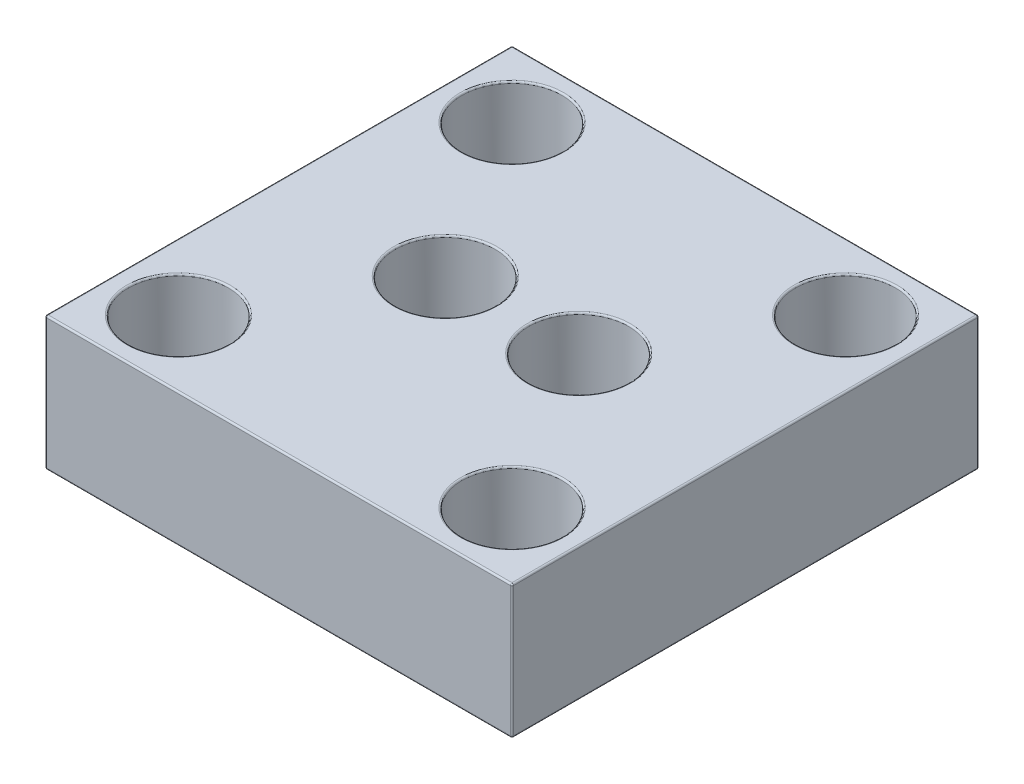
ISO-10303-21;
HEADER;
FILE_DESCRIPTION(('STEP AP214'),'2;1');
FILE_NAME('part.step','',(''),(''),'','','');
FILE_SCHEMA(('AUTOMOTIVE_DESIGN { 1 0 10303 214 1 1 1 1 }'));
ENDSEC;
DATA;
#1=APPLICATION_CONTEXT('core data for automotive mechanical design processes');
#2=APPLICATION_PROTOCOL_DEFINITION('international standard','automotive_design',2000,#1);
#3=PRODUCT_CONTEXT('',#1,'mechanical');
#4=PRODUCT('Part','Part','',(#3));
#5=PRODUCT_RELATED_PRODUCT_CATEGORY('part','',(#4));
#6=PRODUCT_DEFINITION_FORMATION('','',#4);
#7=PRODUCT_DEFINITION_CONTEXT('part definition',#1,'design');
#8=PRODUCT_DEFINITION('design','',#6,#7);
#9=PRODUCT_DEFINITION_SHAPE('','',#8);
#10=(LENGTH_UNIT() NAMED_UNIT(*) SI_UNIT(.MILLI.,.METRE.));
#11=(NAMED_UNIT(*) PLANE_ANGLE_UNIT() SI_UNIT($,.RADIAN.));
#12=(NAMED_UNIT(*) SI_UNIT($,.STERADIAN.) SOLID_ANGLE_UNIT());
#13=UNCERTAINTY_MEASURE_WITH_UNIT(LENGTH_MEASURE(1.E-05),#10,'distance_accuracy_value','');
#14=(GEOMETRIC_REPRESENTATION_CONTEXT(3) GLOBAL_UNCERTAINTY_ASSIGNED_CONTEXT((#13)) GLOBAL_UNIT_ASSIGNED_CONTEXT((#10,
#11,#12)) REPRESENTATION_CONTEXT('',''));
#15=CARTESIAN_POINT('',(0.,0.,0.));
#16=DIRECTION('',(0.,0.,1.));
#17=DIRECTION('',(1.,0.,0.));
#18=AXIS2_PLACEMENT_3D('',#15,#16,#17);
#19=CARTESIAN_POINT('',(60.,0.,-9.99999999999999));
#20=DIRECTION('',(0.,1.,0.));
#21=DIRECTION('',(0.,0.,1.));
#22=AXIS2_PLACEMENT_3D('',#19,#20,#21);
#23=CYLINDRICAL_SURFACE('',#22,4.5);
#24=CARTESIAN_POINT('',(60.,0.25,-9.99999999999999));
#25=DIRECTION('',(0.,-1.,0.));
#26=DIRECTION('',(0.,0.,-1.));
#27=AXIS2_PLACEMENT_3D('',#24,#25,#26);
#28=CIRCLE('',#27,4.5);
#29=CARTESIAN_POINT('',(60.,0.25,-14.5));
#30=VERTEX_POINT('',#29);
#31=EDGE_CURVE('E199',#30,#30,#28,.T.);
#32=ORIENTED_EDGE('',*,*,#31,.T.);
#33=EDGE_LOOP('',(#32));
#34=FACE_BOUND('',#33,.T.);
#35=CARTESIAN_POINT('',(60.,8.,-9.99999999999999));
#36=DIRECTION('',(0.,1.,0.));
#37=DIRECTION('',(0.,0.,1.));
#38=AXIS2_PLACEMENT_3D('',#35,#36,#37);
#39=CIRCLE('',#38,4.5);
#40=CARTESIAN_POINT('',(60.,8.,-5.49999999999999));
#41=VERTEX_POINT('',#40);
#42=EDGE_CURVE('E166',#41,#41,#39,.F.);
#43=ORIENTED_EDGE('',*,*,#42,.F.);
#44=EDGE_LOOP('',(#43));
#45=FACE_BOUND('',#44,.T.);
#46=ADVANCED_FACE('F35',(#34,#45),#23,.F.);
#47=CARTESIAN_POINT('',(60.,0.,-60.));
#48=DIRECTION('',(0.,1.,0.));
#49=DIRECTION('',(0.,0.,1.));
#50=AXIS2_PLACEMENT_3D('',#47,#48,#49);
#51=CYLINDRICAL_SURFACE('',#50,4.5);
#52=CARTESIAN_POINT('',(60.,0.25,-60.));
#53=DIRECTION('',(0.,-1.,0.));
#54=DIRECTION('',(0.,0.,-1.));
#55=AXIS2_PLACEMENT_3D('',#52,#53,#54);
#56=CIRCLE('',#55,4.5);
#57=CARTESIAN_POINT('',(60.,0.25,-64.5));
#58=VERTEX_POINT('',#57);
#59=EDGE_CURVE('E205',#58,#58,#56,.T.);
#60=ORIENTED_EDGE('',*,*,#59,.T.);
#61=EDGE_LOOP('',(#60));
#62=FACE_BOUND('',#61,.T.);
#63=CARTESIAN_POINT('',(60.,8.,-60.));
#64=DIRECTION('',(0.,1.,0.));
#65=DIRECTION('',(0.,0.,1.));
#66=AXIS2_PLACEMENT_3D('',#63,#64,#65);
#67=CIRCLE('',#66,4.5);
#68=CARTESIAN_POINT('',(60.,8.,-55.5));
#69=VERTEX_POINT('',#68);
#70=EDGE_CURVE('E348',#69,#69,#67,.F.);
#71=ORIENTED_EDGE('',*,*,#70,.F.);
#72=EDGE_LOOP('',(#71));
#73=FACE_BOUND('',#72,.T.);
#74=ADVANCED_FACE('F373',(#62,#73),#51,.F.);
#75=CARTESIAN_POINT('',(45.,0.,-35.));
#76=DIRECTION('',(0.,1.,0.));
#77=DIRECTION('',(0.,0.,1.));
#78=AXIS2_PLACEMENT_3D('',#75,#76,#77);
#79=CYLINDRICAL_SURFACE('',#78,4.50000000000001);
#80=CARTESIAN_POINT('',(45.,0.25,-35.));
#81=DIRECTION('',(0.,-1.,0.));
#82=DIRECTION('',(0.,0.,-1.));
#83=AXIS2_PLACEMENT_3D('',#80,#81,#82);
#84=CIRCLE('',#83,4.50000000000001);
#85=CARTESIAN_POINT('',(45.,0.25,-39.5));
#86=VERTEX_POINT('',#85);
#87=EDGE_CURVE('E202',#86,#86,#84,.T.);
#88=ORIENTED_EDGE('',*,*,#87,.T.);
#89=EDGE_LOOP('',(#88));
#90=FACE_BOUND('',#89,.T.);
#91=CARTESIAN_POINT('',(45.,8.,-35.));
#92=DIRECTION('',(0.,1.,0.));
#93=DIRECTION('',(0.,0.,1.));
#94=AXIS2_PLACEMENT_3D('',#91,#92,#93);
#95=CIRCLE('',#94,4.50000000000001);
#96=CARTESIAN_POINT('',(45.,8.,-30.5));
#97=VERTEX_POINT('',#96);
#98=EDGE_CURVE('E352',#97,#97,#95,.F.);
#99=ORIENTED_EDGE('',*,*,#98,.F.);
#100=EDGE_LOOP('',(#99));
#101=FACE_BOUND('',#100,.T.);
#102=ADVANCED_FACE('F375',(#90,#101),#79,.F.);
#103=CARTESIAN_POINT('',(10.,0.,-9.99999999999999));
#104=DIRECTION('',(0.,1.,0.));
#105=DIRECTION('',(0.,0.,1.));
#106=AXIS2_PLACEMENT_3D('',#103,#104,#105);
#107=CYLINDRICAL_SURFACE('',#106,4.5);
#108=CARTESIAN_POINT('',(10.,0.25,-9.99999999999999));
#109=DIRECTION('',(0.,-1.,0.));
#110=DIRECTION('',(0.,0.,-1.));
#111=AXIS2_PLACEMENT_3D('',#108,#109,#110);
#112=CIRCLE('',#111,4.5);
#113=CARTESIAN_POINT('',(10.,0.25,-14.5));
#114=VERTEX_POINT('',#113);
#115=EDGE_CURVE('E196',#114,#114,#112,.T.);
#116=ORIENTED_EDGE('',*,*,#115,.T.);
#117=EDGE_LOOP('',(#116));
#118=FACE_BOUND('',#117,.T.);
#119=CARTESIAN_POINT('',(10.,8.,-9.99999999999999));
#120=DIRECTION('',(0.,1.,0.));
#121=DIRECTION('',(0.,0.,1.));
#122=AXIS2_PLACEMENT_3D('',#119,#120,#121);
#123=CIRCLE('',#122,4.5);
#124=CARTESIAN_POINT('',(10.,8.,-5.49999999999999));
#125=VERTEX_POINT('',#124);
#126=EDGE_CURVE('E356',#125,#125,#123,.F.);
#127=ORIENTED_EDGE('',*,*,#126,.F.);
#128=EDGE_LOOP('',(#127));
#129=FACE_BOUND('',#128,.T.);
#130=ADVANCED_FACE('F382',(#118,#129),#107,.F.);
#131=CARTESIAN_POINT('',(25.,0.,-35.));
#132=DIRECTION('',(0.,1.,0.));
#133=DIRECTION('',(0.,0.,1.));
#134=AXIS2_PLACEMENT_3D('',#131,#132,#133);
#135=CYLINDRICAL_SURFACE('',#134,4.50000000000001);
#136=CARTESIAN_POINT('',(25.,0.25,-35.));
#137=DIRECTION('',(0.,-1.,0.));
#138=DIRECTION('',(0.,0.,-1.));
#139=AXIS2_PLACEMENT_3D('',#136,#137,#138);
#140=CIRCLE('',#139,4.50000000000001);
#141=CARTESIAN_POINT('',(25.,0.25,-39.5));
#142=VERTEX_POINT('',#141);
#143=EDGE_CURVE('E193',#142,#142,#140,.T.);
#144=ORIENTED_EDGE('',*,*,#143,.T.);
#145=EDGE_LOOP('',(#144));
#146=FACE_BOUND('',#145,.T.);
#147=CARTESIAN_POINT('',(25.,8.,-35.));
#148=DIRECTION('',(0.,1.,0.));
#149=DIRECTION('',(0.,0.,1.));
#150=AXIS2_PLACEMENT_3D('',#147,#148,#149);
#151=CIRCLE('',#150,4.50000000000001);
#152=CARTESIAN_POINT('',(25.,8.,-30.5));
#153=VERTEX_POINT('',#152);
#154=EDGE_CURVE('E360',#153,#153,#151,.F.);
#155=ORIENTED_EDGE('',*,*,#154,.F.);
#156=EDGE_LOOP('',(#155));
#157=FACE_BOUND('',#156,.T.);
#158=ADVANCED_FACE('F393',(#146,#157),#135,.F.);
#159=CARTESIAN_POINT('',(10.,0.,-60.));
#160=DIRECTION('',(0.,1.,0.));
#161=DIRECTION('',(0.,0.,1.));
#162=AXIS2_PLACEMENT_3D('',#159,#160,#161);
#163=CYLINDRICAL_SURFACE('',#162,4.5);
#164=CARTESIAN_POINT('',(10.,0.25,-60.));
#165=DIRECTION('',(0.,-1.,0.));
#166=DIRECTION('',(0.,0.,-1.));
#167=AXIS2_PLACEMENT_3D('',#164,#165,#166);
#168=CIRCLE('',#167,4.5);
#169=CARTESIAN_POINT('',(10.,0.25,-64.5));
#170=VERTEX_POINT('',#169);
#171=EDGE_CURVE('E190',#170,#170,#168,.T.);
#172=ORIENTED_EDGE('',*,*,#171,.T.);
#173=EDGE_LOOP('',(#172));
#174=FACE_BOUND('',#173,.T.);
#175=CARTESIAN_POINT('',(10.,8.,-60.));
#176=DIRECTION('',(0.,1.,0.));
#177=DIRECTION('',(0.,0.,1.));
#178=AXIS2_PLACEMENT_3D('',#175,#176,#177);
#179=CIRCLE('',#178,4.5);
#180=CARTESIAN_POINT('',(10.,8.,-55.5));
#181=VERTEX_POINT('',#180);
#182=EDGE_CURVE('E160',#181,#181,#179,.F.);
#183=ORIENTED_EDGE('',*,*,#182,.F.);
#184=EDGE_LOOP('',(#183));
#185=FACE_BOUND('',#184,.T.);
#186=ADVANCED_FACE('F397',(#174,#185),#163,.F.);
#187=CARTESIAN_POINT('',(0.,20.,0.));
#188=DIRECTION('',(1.,0.,0.));
#189=DIRECTION('',(0.,0.,-1.));
#190=AXIS2_PLACEMENT_3D('',#187,#188,#189);
#191=PLANE('',#190);
#192=DIRECTION('',(0.,-1.,0.));
#193=VECTOR('',#192,1.);
#194=CARTESIAN_POINT('',(0.,20.,-69.75));
#195=LINE('',#194,#193);
#196=CARTESIAN_POINT('',(0.,19.75,-69.75));
#197=VERTEX_POINT('',#196);
#198=CARTESIAN_POINT('',(0.,0.25,-69.75));
#199=VERTEX_POINT('',#198);
#200=EDGE_CURVE('E212',#197,#199,#195,.T.);
#201=ORIENTED_EDGE('',*,*,#200,.T.);
#202=DIRECTION('',(0.,0.,1.));
#203=VECTOR('',#202,1.);
#204=CARTESIAN_POINT('',(0.,0.25,0.));
#205=LINE('',#204,#203);
#206=CARTESIAN_POINT('',(0.,0.25,-0.25));
#207=VERTEX_POINT('',#206);
#208=EDGE_CURVE('E214',#199,#207,#205,.T.);
#209=ORIENTED_EDGE('',*,*,#208,.T.);
#210=DIRECTION('',(0.,-1.,0.));
#211=VECTOR('',#210,1.);
#212=CARTESIAN_POINT('',(0.,20.,-0.25));
#213=LINE('',#212,#211);
#214=CARTESIAN_POINT('',(0.,19.75,-0.25));
#215=VERTEX_POINT('',#214);
#216=EDGE_CURVE('E210',#207,#215,#213,.F.);
#217=ORIENTED_EDGE('',*,*,#216,.T.);
#218=DIRECTION('',(0.,0.,1.));
#219=VECTOR('',#218,1.);
#220=CARTESIAN_POINT('',(0.,19.75,0.));
#221=LINE('',#220,#219);
#222=EDGE_CURVE('E208',#215,#197,#221,.F.);
#223=ORIENTED_EDGE('',*,*,#222,.T.);
#224=EDGE_LOOP('',(#201,#209,#217,#223));
#225=FACE_BOUND('',#224,.T.);
#226=ADVANCED_FACE('F401',(#225),#191,.F.);
#227=CARTESIAN_POINT('',(0.,20.,0.));
#228=DIRECTION('',(0.,0.,-1.));
#229=DIRECTION('',(-1.,0.,0.));
#230=AXIS2_PLACEMENT_3D('',#227,#228,#229);
#231=PLANE('',#230);
#232=DIRECTION('',(0.,-1.,0.));
#233=VECTOR('',#232,1.);
#234=CARTESIAN_POINT('',(0.25,20.,0.));
#235=LINE('',#234,#233);
#236=CARTESIAN_POINT('',(0.25,19.75,0.));
#237=VERTEX_POINT('',#236);
#238=CARTESIAN_POINT('',(0.25,0.25,0.));
#239=VERTEX_POINT('',#238);
#240=EDGE_CURVE('E238',#237,#239,#235,.T.);
#241=ORIENTED_EDGE('',*,*,#240,.T.);
#242=DIRECTION('',(1.,0.,0.));
#243=VECTOR('',#242,1.);
#244=CARTESIAN_POINT('',(70.,0.25,0.));
#245=LINE('',#244,#243);
#246=CARTESIAN_POINT('',(69.75,0.25,0.));
#247=VERTEX_POINT('',#246);
#248=EDGE_CURVE('E241',#239,#247,#245,.T.);
#249=ORIENTED_EDGE('',*,*,#248,.T.);
#250=DIRECTION('',(0.,-1.,0.));
#251=VECTOR('',#250,1.);
#252=CARTESIAN_POINT('',(69.75,20.,0.));
#253=LINE('',#252,#251);
#254=CARTESIAN_POINT('',(69.75,19.75,0.));
#255=VERTEX_POINT('',#254);
#256=EDGE_CURVE('E236',#247,#255,#253,.F.);
#257=ORIENTED_EDGE('',*,*,#256,.T.);
#258=DIRECTION('',(1.,0.,0.));
#259=VECTOR('',#258,1.);
#260=CARTESIAN_POINT('',(0.,19.75,0.));
#261=LINE('',#260,#259);
#262=EDGE_CURVE('E234',#255,#237,#261,.F.);
#263=ORIENTED_EDGE('',*,*,#262,.T.);
#264=EDGE_LOOP('',(#241,#249,#257,#263));
#265=FACE_BOUND('',#264,.T.);
#266=ADVANCED_FACE('F417',(#265),#231,.F.);
#267=CARTESIAN_POINT('',(70.,20.,0.));
#268=DIRECTION('',(-1.,0.,0.));
#269=DIRECTION('',(0.,0.,1.));
#270=AXIS2_PLACEMENT_3D('',#267,#268,#269);
#271=PLANE('',#270);
#272=DIRECTION('',(0.,0.,-1.));
#273=VECTOR('',#272,1.);
#274=CARTESIAN_POINT('',(70.,0.25,-70.));
#275=LINE('',#274,#273);
#276=CARTESIAN_POINT('',(70.,0.25,-0.25));
#277=VERTEX_POINT('',#276);
#278=CARTESIAN_POINT('',(70.,0.25,-69.75));
#279=VERTEX_POINT('',#278);
#280=EDGE_CURVE('E142',#277,#279,#275,.T.);
#281=ORIENTED_EDGE('',*,*,#280,.T.);
#282=DIRECTION('',(0.,-1.,0.));
#283=VECTOR('',#282,1.);
#284=CARTESIAN_POINT('',(70.,20.,-69.75));
#285=LINE('',#284,#283);
#286=CARTESIAN_POINT('',(70.,19.75,-69.75));
#287=VERTEX_POINT('',#286);
#288=EDGE_CURVE('E231',#279,#287,#285,.F.);
#289=ORIENTED_EDGE('',*,*,#288,.T.);
#290=DIRECTION('',(0.,0.,-1.));
#291=VECTOR('',#290,1.);
#292=CARTESIAN_POINT('',(70.,19.75,0.));
#293=LINE('',#292,#291);
#294=CARTESIAN_POINT('',(70.,19.75,-0.25));
#295=VERTEX_POINT('',#294);
#296=EDGE_CURVE('E226',#287,#295,#293,.F.);
#297=ORIENTED_EDGE('',*,*,#296,.T.);
#298=DIRECTION('',(0.,-1.,0.));
#299=VECTOR('',#298,1.);
#300=CARTESIAN_POINT('',(70.,20.,-0.25));
#301=LINE('',#300,#299);
#302=EDGE_CURVE('E228',#295,#277,#301,.T.);
#303=ORIENTED_EDGE('',*,*,#302,.T.);
#304=EDGE_LOOP('',(#281,#289,#297,#303));
#305=FACE_BOUND('',#304,.T.);
#306=ADVANCED_FACE('F413',(#305),#271,.F.);
#307=CARTESIAN_POINT('',(0.,20.,-70.));
#308=DIRECTION('',(0.,0.,1.));
#309=DIRECTION('',(1.,0.,0.));
#310=AXIS2_PLACEMENT_3D('',#307,#308,#309);
#311=PLANE('',#310);
#312=DIRECTION('',(-1.,0.,0.));
#313=VECTOR('',#312,1.);
#314=CARTESIAN_POINT('',(0.,0.25,-70.));
#315=LINE('',#314,#313);
#316=CARTESIAN_POINT('',(69.75,0.25,-70.));
#317=VERTEX_POINT('',#316);
#318=CARTESIAN_POINT('',(0.25,0.25,-70.));
#319=VERTEX_POINT('',#318);
#320=EDGE_CURVE('E221',#317,#319,#315,.T.);
#321=ORIENTED_EDGE('',*,*,#320,.T.);
#322=DIRECTION('',(0.,-1.,0.));
#323=VECTOR('',#322,1.);
#324=CARTESIAN_POINT('',(0.25,20.,-70.));
#325=LINE('',#324,#323);
#326=CARTESIAN_POINT('',(0.25,19.75,-70.));
#327=VERTEX_POINT('',#326);
#328=EDGE_CURVE('E223',#319,#327,#325,.F.);
#329=ORIENTED_EDGE('',*,*,#328,.T.);
#330=DIRECTION('',(-1.,0.,0.));
#331=VECTOR('',#330,1.);
#332=CARTESIAN_POINT('',(0.,19.75,-70.));
#333=LINE('',#332,#331);
#334=CARTESIAN_POINT('',(69.75,19.75,-70.));
#335=VERTEX_POINT('',#334);
#336=EDGE_CURVE('E217',#327,#335,#333,.F.);
#337=ORIENTED_EDGE('',*,*,#336,.T.);
#338=DIRECTION('',(0.,-1.,0.));
#339=VECTOR('',#338,1.);
#340=CARTESIAN_POINT('',(69.75,20.,-70.));
#341=LINE('',#340,#339);
#342=EDGE_CURVE('E219',#335,#317,#341,.T.);
#343=ORIENTED_EDGE('',*,*,#342,.T.);
#344=EDGE_LOOP('',(#321,#329,#337,#343));
#345=FACE_BOUND('',#344,.T.);
#346=ADVANCED_FACE('F406',(#345),#311,.F.);
#347=CARTESIAN_POINT('',(0.,20.,-70.));
#348=DIRECTION('',(0.,-1.,0.));
#349=DIRECTION('',(0.,0.,-1.));
#350=AXIS2_PLACEMENT_3D('',#347,#348,#349);
#351=PLANE('',#350);
#352=DIRECTION('',(0.,0.,-1.));
#353=VECTOR('',#352,1.);
#354=CARTESIAN_POINT('',(69.75,20.,-70.));
#355=LINE('',#354,#353);
#356=CARTESIAN_POINT('',(69.75,20.,-0.25));
#357=VERTEX_POINT('',#356);
#358=CARTESIAN_POINT('',(69.75,20.,-69.75));
#359=VERTEX_POINT('',#358);
#360=EDGE_CURVE('E52',#357,#359,#355,.T.);
#361=ORIENTED_EDGE('',*,*,#360,.T.);
#362=DIRECTION('',(-1.,0.,0.));
#363=VECTOR('',#362,1.);
#364=CARTESIAN_POINT('',(0.,20.,-69.75));
#365=LINE('',#364,#363);
#366=CARTESIAN_POINT('',(0.25,20.,-69.75));
#367=VERTEX_POINT('',#366);
#368=EDGE_CURVE('E265',#359,#367,#365,.T.);
#369=ORIENTED_EDGE('',*,*,#368,.T.);
#370=DIRECTION('',(0.,0.,1.));
#371=VECTOR('',#370,1.);
#372=CARTESIAN_POINT('',(0.25,20.,-70.));
#373=LINE('',#372,#371);
#374=CARTESIAN_POINT('',(0.25,20.,-0.25));
#375=VERTEX_POINT('',#374);
#376=EDGE_CURVE('E261',#367,#375,#373,.T.);
#377=ORIENTED_EDGE('',*,*,#376,.T.);
#378=DIRECTION('',(1.,0.,0.));
#379=VECTOR('',#378,1.);
#380=CARTESIAN_POINT('',(0.,20.,-0.25));
#381=LINE('',#380,#379);
#382=EDGE_CURVE('E57',#375,#357,#381,.T.);
#383=ORIENTED_EDGE('',*,*,#382,.T.);
#384=EDGE_LOOP('',(#361,#369,#377,#383));
#385=FACE_BOUND('',#384,.T.);
#386=CARTESIAN_POINT('',(10.,20.,-60.));
#387=DIRECTION('',(0.,-1.,0.));
#388=DIRECTION('',(0.,0.,-1.));
#389=AXIS2_PLACEMENT_3D('',#386,#387,#388);
#390=CIRCLE('',#389,7.75);
#391=CARTESIAN_POINT('',(10.,20.,-67.75));
#392=VERTEX_POINT('',#391);
#393=EDGE_CURVE('E258',#392,#392,#390,.T.);
#394=ORIENTED_EDGE('',*,*,#393,.T.);
#395=EDGE_LOOP('',(#394));
#396=FACE_BOUND('',#395,.T.);
#397=CARTESIAN_POINT('',(25.,20.,-35.));
#398=DIRECTION('',(0.,-1.,0.));
#399=DIRECTION('',(0.,0.,-1.));
#400=AXIS2_PLACEMENT_3D('',#397,#398,#399);
#401=CIRCLE('',#400,7.75);
#402=CARTESIAN_POINT('',(25.,20.,-42.75));
#403=VERTEX_POINT('',#402);
#404=EDGE_CURVE('E255',#403,#403,#401,.T.);
#405=ORIENTED_EDGE('',*,*,#404,.T.);
#406=EDGE_LOOP('',(#405));
#407=FACE_BOUND('',#406,.T.);
#408=CARTESIAN_POINT('',(10.,20.,-9.99999999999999));
#409=DIRECTION('',(0.,-1.,0.));
#410=DIRECTION('',(0.,0.,-1.));
#411=AXIS2_PLACEMENT_3D('',#408,#409,#410);
#412=CIRCLE('',#411,7.75);
#413=CARTESIAN_POINT('',(10.,20.,-17.75));
#414=VERTEX_POINT('',#413);
#415=EDGE_CURVE('E252',#414,#414,#412,.T.);
#416=ORIENTED_EDGE('',*,*,#415,.T.);
#417=EDGE_LOOP('',(#416));
#418=FACE_BOUND('',#417,.T.);
#419=CARTESIAN_POINT('',(45.,20.,-35.));
#420=DIRECTION('',(0.,-1.,0.));
#421=DIRECTION('',(0.,0.,-1.));
#422=AXIS2_PLACEMENT_3D('',#419,#420,#421);
#423=CIRCLE('',#422,7.75);
#424=CARTESIAN_POINT('',(45.,20.,-42.75));
#425=VERTEX_POINT('',#424);
#426=EDGE_CURVE('E249',#425,#425,#423,.T.);
#427=ORIENTED_EDGE('',*,*,#426,.T.);
#428=EDGE_LOOP('',(#427));
#429=FACE_BOUND('',#428,.T.);
#430=CARTESIAN_POINT('',(60.,20.,-60.));
#431=DIRECTION('',(0.,-1.,0.));
#432=DIRECTION('',(0.,0.,-1.));
#433=AXIS2_PLACEMENT_3D('',#430,#431,#432);
#434=CIRCLE('',#433,7.75000000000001);
#435=CARTESIAN_POINT('',(60.,20.,-67.75));
#436=VERTEX_POINT('',#435);
#437=EDGE_CURVE('E246',#436,#436,#434,.T.);
#438=ORIENTED_EDGE('',*,*,#437,.T.);
#439=EDGE_LOOP('',(#438));
#440=FACE_BOUND('',#439,.T.);
#441=CARTESIAN_POINT('',(60.,20.,-9.99999999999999));
#442=DIRECTION('',(0.,-1.,0.));
#443=DIRECTION('',(0.,0.,-1.));
#444=AXIS2_PLACEMENT_3D('',#441,#442,#443);
#445=CIRCLE('',#444,7.75000000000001);
#446=CARTESIAN_POINT('',(60.,20.,-17.75));
#447=VERTEX_POINT('',#446);
#448=EDGE_CURVE('E243',#447,#447,#445,.T.);
#449=ORIENTED_EDGE('',*,*,#448,.T.);
#450=EDGE_LOOP('',(#449));
#451=FACE_BOUND('',#450,.T.);
#452=ADVANCED_FACE('F403',(#385,#396,#407,#418,#429,#440,#451),#351,.F.);
#453=CARTESIAN_POINT('',(0.,0.,-70.));
#454=DIRECTION('',(0.,-1.,0.));
#455=DIRECTION('',(0.,0.,-1.));
#456=AXIS2_PLACEMENT_3D('',#453,#454,#455);
#457=PLANE('',#456);
#458=CARTESIAN_POINT('',(10.,0.,-60.));
#459=DIRECTION('',(0.,-1.,0.));
#460=DIRECTION('',(0.,0.,-1.));
#461=AXIS2_PLACEMENT_3D('',#458,#459,#460);
#462=CIRCLE('',#461,4.75);
#463=CARTESIAN_POINT('',(10.,0.,-64.75));
#464=VERTEX_POINT('',#463);
#465=EDGE_CURVE('E187',#464,#464,#462,.F.);
#466=ORIENTED_EDGE('',*,*,#465,.T.);
#467=EDGE_LOOP('',(#466));
#468=FACE_BOUND('',#467,.T.);
#469=CARTESIAN_POINT('',(25.,0.,-35.));
#470=DIRECTION('',(0.,-1.,0.));
#471=DIRECTION('',(0.,0.,-1.));
#472=AXIS2_PLACEMENT_3D('',#469,#470,#471);
#473=CIRCLE('',#472,4.75000000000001);
#474=CARTESIAN_POINT('',(25.,0.,-39.75));
#475=VERTEX_POINT('',#474);
#476=EDGE_CURVE('E184',#475,#475,#473,.F.);
#477=ORIENTED_EDGE('',*,*,#476,.T.);
#478=EDGE_LOOP('',(#477));
#479=FACE_BOUND('',#478,.T.);
#480=CARTESIAN_POINT('',(10.,0.,-9.99999999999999));
#481=DIRECTION('',(0.,-1.,0.));
#482=DIRECTION('',(0.,0.,-1.));
#483=AXIS2_PLACEMENT_3D('',#480,#481,#482);
#484=CIRCLE('',#483,4.75);
#485=CARTESIAN_POINT('',(10.,0.,-14.75));
#486=VERTEX_POINT('',#485);
#487=EDGE_CURVE('E181',#486,#486,#484,.F.);
#488=ORIENTED_EDGE('',*,*,#487,.T.);
#489=EDGE_LOOP('',(#488));
#490=FACE_BOUND('',#489,.T.);
#491=CARTESIAN_POINT('',(60.,0.,-9.99999999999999));
#492=DIRECTION('',(0.,-1.,0.));
#493=DIRECTION('',(0.,0.,-1.));
#494=AXIS2_PLACEMENT_3D('',#491,#492,#493);
#495=CIRCLE('',#494,4.75000000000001);
#496=CARTESIAN_POINT('',(60.,0.,-14.75));
#497=VERTEX_POINT('',#496);
#498=EDGE_CURVE('E178',#497,#497,#495,.F.);
#499=ORIENTED_EDGE('',*,*,#498,.T.);
#500=EDGE_LOOP('',(#499));
#501=FACE_BOUND('',#500,.T.);
#502=CARTESIAN_POINT('',(45.,0.,-35.));
#503=DIRECTION('',(0.,-1.,0.));
#504=DIRECTION('',(0.,0.,-1.));
#505=AXIS2_PLACEMENT_3D('',#502,#503,#504);
#506=CIRCLE('',#505,4.75000000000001);
#507=CARTESIAN_POINT('',(45.,0.,-39.75));
#508=VERTEX_POINT('',#507);
#509=EDGE_CURVE('E175',#508,#508,#506,.F.);
#510=ORIENTED_EDGE('',*,*,#509,.T.);
#511=EDGE_LOOP('',(#510));
#512=FACE_BOUND('',#511,.T.);
#513=CARTESIAN_POINT('',(60.,0.,-60.));
#514=DIRECTION('',(0.,-1.,0.));
#515=DIRECTION('',(0.,0.,-1.));
#516=AXIS2_PLACEMENT_3D('',#513,#514,#515);
#517=CIRCLE('',#516,4.75);
#518=CARTESIAN_POINT('',(60.,0.,-64.75));
#519=VERTEX_POINT('',#518);
#520=EDGE_CURVE('E172',#519,#519,#517,.F.);
#521=ORIENTED_EDGE('',*,*,#520,.T.);
#522=EDGE_LOOP('',(#521));
#523=FACE_BOUND('',#522,.T.);
#524=DIRECTION('',(1.,0.,0.));
#525=VECTOR('',#524,1.);
#526=CARTESIAN_POINT('',(0.,0.,-0.25));
#527=LINE('',#526,#525);
#528=CARTESIAN_POINT('',(69.75,0.,-0.25));
#529=VERTEX_POINT('',#528);
#530=CARTESIAN_POINT('',(0.25,0.,-0.25));
#531=VERTEX_POINT('',#530);
#532=EDGE_CURVE('E129',#529,#531,#527,.F.);
#533=ORIENTED_EDGE('',*,*,#532,.T.);
#534=DIRECTION('',(0.,0.,1.));
#535=VECTOR('',#534,1.);
#536=CARTESIAN_POINT('',(0.25,0.,-70.));
#537=LINE('',#536,#535);
#538=CARTESIAN_POINT('',(0.25,0.,-69.75));
#539=VERTEX_POINT('',#538);
#540=EDGE_CURVE('E170',#531,#539,#537,.F.);
#541=ORIENTED_EDGE('',*,*,#540,.T.);
#542=DIRECTION('',(-1.,0.,0.));
#543=VECTOR('',#542,1.);
#544=CARTESIAN_POINT('',(70.,0.,-69.75));
#545=LINE('',#544,#543);
#546=CARTESIAN_POINT('',(69.75,0.,-69.75));
#547=VERTEX_POINT('',#546);
#548=EDGE_CURVE('E132',#539,#547,#545,.F.);
#549=ORIENTED_EDGE('',*,*,#548,.T.);
#550=DIRECTION('',(0.,0.,-1.));
#551=VECTOR('',#550,1.);
#552=CARTESIAN_POINT('',(69.75,0.,0.));
#553=LINE('',#552,#551);
#554=EDGE_CURVE('E124',#547,#529,#553,.F.);
#555=ORIENTED_EDGE('',*,*,#554,.T.);
#556=EDGE_LOOP('',(#533,#541,#549,#555));
#557=FACE_BOUND('',#556,.T.);
#558=ADVANCED_FACE('F126',(#468,#479,#490,#501,#512,#523,#557),#457,.T.);
#559=CARTESIAN_POINT('',(10.,8.,-60.));
#560=DIRECTION('',(0.,1.,0.));
#561=DIRECTION('',(0.,0.,1.));
#562=AXIS2_PLACEMENT_3D('',#559,#560,#561);
#563=PLANE('',#562);
#564=CARTESIAN_POINT('',(10.,8.,-60.));
#565=DIRECTION('',(0.,1.,0.));
#566=DIRECTION('',(0.,0.,1.));
#567=AXIS2_PLACEMENT_3D('',#564,#565,#566);
#568=CIRCLE('',#567,7.5);
#569=CARTESIAN_POINT('',(10.,8.,-52.5));
#570=VERTEX_POINT('',#569);
#571=EDGE_CURVE('E163',#570,#570,#568,.T.);
#572=ORIENTED_EDGE('',*,*,#571,.T.);
#573=EDGE_LOOP('',(#572));
#574=FACE_BOUND('',#573,.T.);
#575=ORIENTED_EDGE('',*,*,#182,.T.);
#576=EDGE_LOOP('',(#575));
#577=FACE_BOUND('',#576,.T.);
#578=ADVANCED_FACE('F409',(#574,#577),#563,.T.);
#579=CARTESIAN_POINT('',(10.,8.,-60.));
#580=DIRECTION('',(0.,1.,0.));
#581=DIRECTION('',(0.,0.,1.));
#582=AXIS2_PLACEMENT_3D('',#579,#580,#581);
#583=CYLINDRICAL_SURFACE('',#582,7.5);
#584=CARTESIAN_POINT('',(10.,19.75,-60.));
#585=DIRECTION('',(0.,-1.,0.));
#586=DIRECTION('',(0.,0.,-1.));
#587=AXIS2_PLACEMENT_3D('',#584,#585,#586);
#588=CIRCLE('',#587,7.5);
#589=CARTESIAN_POINT('',(10.,19.75,-67.5));
#590=VERTEX_POINT('',#589);
#591=EDGE_CURVE('E267',#590,#590,#588,.F.);
#592=ORIENTED_EDGE('',*,*,#591,.T.);
#593=EDGE_LOOP('',(#592));
#594=FACE_BOUND('',#593,.T.);
#595=ORIENTED_EDGE('',*,*,#571,.F.);
#596=EDGE_LOOP('',(#595));
#597=FACE_BOUND('',#596,.T.);
#598=ADVANCED_FACE('F388',(#594,#597),#583,.F.);
#599=CARTESIAN_POINT('',(25.,8.,-35.));
#600=DIRECTION('',(0.,1.,0.));
#601=DIRECTION('',(0.,0.,1.));
#602=AXIS2_PLACEMENT_3D('',#599,#600,#601);
#603=PLANE('',#602);
#604=CARTESIAN_POINT('',(25.,8.,-35.));
#605=DIRECTION('',(0.,1.,0.));
#606=DIRECTION('',(0.,0.,1.));
#607=AXIS2_PLACEMENT_3D('',#604,#605,#606);
#608=CIRCLE('',#607,7.5);
#609=CARTESIAN_POINT('',(25.,8.,-27.5));
#610=VERTEX_POINT('',#609);
#611=EDGE_CURVE('E357',#610,#610,#608,.T.);
#612=ORIENTED_EDGE('',*,*,#611,.T.);
#613=EDGE_LOOP('',(#612));
#614=FACE_BOUND('',#613,.T.);
#615=ORIENTED_EDGE('',*,*,#154,.T.);
#616=EDGE_LOOP('',(#615));
#617=FACE_BOUND('',#616,.T.);
#618=ADVANCED_FACE('F579',(#614,#617),#603,.T.);
#619=CARTESIAN_POINT('',(25.,8.,-35.));
#620=DIRECTION('',(0.,1.,0.));
#621=DIRECTION('',(0.,0.,1.));
#622=AXIS2_PLACEMENT_3D('',#619,#620,#621);
#623=CYLINDRICAL_SURFACE('',#622,7.5);
#624=CARTESIAN_POINT('',(25.,19.75,-35.));
#625=DIRECTION('',(0.,-1.,0.));
#626=DIRECTION('',(0.,0.,-1.));
#627=AXIS2_PLACEMENT_3D('',#624,#625,#626);
#628=CIRCLE('',#627,7.5);
#629=CARTESIAN_POINT('',(25.,19.75,-42.5));
#630=VERTEX_POINT('',#629);
#631=EDGE_CURVE('E270',#630,#630,#628,.F.);
#632=ORIENTED_EDGE('',*,*,#631,.T.);
#633=EDGE_LOOP('',(#632));
#634=FACE_BOUND('',#633,.T.);
#635=ORIENTED_EDGE('',*,*,#611,.F.);
#636=EDGE_LOOP('',(#635));
#637=FACE_BOUND('',#636,.T.);
#638=ADVANCED_FACE('F574',(#634,#637),#623,.F.);
#639=CARTESIAN_POINT('',(10.,8.,-9.99999999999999));
#640=DIRECTION('',(0.,1.,0.));
#641=DIRECTION('',(0.,0.,1.));
#642=AXIS2_PLACEMENT_3D('',#639,#640,#641);
#643=PLANE('',#642);
#644=CARTESIAN_POINT('',(10.,8.,-9.99999999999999));
#645=DIRECTION('',(0.,1.,0.));
#646=DIRECTION('',(0.,0.,1.));
#647=AXIS2_PLACEMENT_3D('',#644,#645,#646);
#648=CIRCLE('',#647,7.5);
#649=CARTESIAN_POINT('',(10.,8.,-2.5));
#650=VERTEX_POINT('',#649);
#651=EDGE_CURVE('E353',#650,#650,#648,.T.);
#652=ORIENTED_EDGE('',*,*,#651,.T.);
#653=EDGE_LOOP('',(#652));
#654=FACE_BOUND('',#653,.T.);
#655=ORIENTED_EDGE('',*,*,#126,.T.);
#656=EDGE_LOOP('',(#655));
#657=FACE_BOUND('',#656,.T.);
#658=ADVANCED_FACE('F571',(#654,#657),#643,.T.);
#659=CARTESIAN_POINT('',(10.,8.,-9.99999999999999));
#660=DIRECTION('',(0.,1.,0.));
#661=DIRECTION('',(0.,0.,1.));
#662=AXIS2_PLACEMENT_3D('',#659,#660,#661);
#663=CYLINDRICAL_SURFACE('',#662,7.5);
#664=CARTESIAN_POINT('',(10.,19.75,-9.99999999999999));
#665=DIRECTION('',(0.,-1.,0.));
#666=DIRECTION('',(0.,0.,-1.));
#667=AXIS2_PLACEMENT_3D('',#664,#665,#666);
#668=CIRCLE('',#667,7.5);
#669=CARTESIAN_POINT('',(10.,19.75,-17.5));
#670=VERTEX_POINT('',#669);
#671=EDGE_CURVE('E273',#670,#670,#668,.F.);
#672=ORIENTED_EDGE('',*,*,#671,.T.);
#673=EDGE_LOOP('',(#672));
#674=FACE_BOUND('',#673,.T.);
#675=ORIENTED_EDGE('',*,*,#651,.F.);
#676=EDGE_LOOP('',(#675));
#677=FACE_BOUND('',#676,.T.);
#678=ADVANCED_FACE('F568',(#674,#677),#663,.F.);
#679=CARTESIAN_POINT('',(45.,8.,-35.));
#680=DIRECTION('',(0.,1.,0.));
#681=DIRECTION('',(0.,0.,1.));
#682=AXIS2_PLACEMENT_3D('',#679,#680,#681);
#683=PLANE('',#682);
#684=CARTESIAN_POINT('',(45.,8.,-35.));
#685=DIRECTION('',(0.,1.,0.));
#686=DIRECTION('',(0.,0.,1.));
#687=AXIS2_PLACEMENT_3D('',#684,#685,#686);
#688=CIRCLE('',#687,7.5);
#689=CARTESIAN_POINT('',(45.,8.,-27.5));
#690=VERTEX_POINT('',#689);
#691=EDGE_CURVE('E349',#690,#690,#688,.T.);
#692=ORIENTED_EDGE('',*,*,#691,.T.);
#693=EDGE_LOOP('',(#692));
#694=FACE_BOUND('',#693,.T.);
#695=ORIENTED_EDGE('',*,*,#98,.T.);
#696=EDGE_LOOP('',(#695));
#697=FACE_BOUND('',#696,.T.);
#698=ADVANCED_FACE('F561',(#694,#697),#683,.T.);
#699=CARTESIAN_POINT('',(45.,8.,-35.));
#700=DIRECTION('',(0.,1.,0.));
#701=DIRECTION('',(0.,0.,1.));
#702=AXIS2_PLACEMENT_3D('',#699,#700,#701);
#703=CYLINDRICAL_SURFACE('',#702,7.5);
#704=CARTESIAN_POINT('',(45.,19.75,-35.));
#705=DIRECTION('',(0.,-1.,0.));
#706=DIRECTION('',(0.,0.,-1.));
#707=AXIS2_PLACEMENT_3D('',#704,#705,#706);
#708=CIRCLE('',#707,7.5);
#709=CARTESIAN_POINT('',(45.,19.75,-42.5));
#710=VERTEX_POINT('',#709);
#711=EDGE_CURVE('E276',#710,#710,#708,.F.);
#712=ORIENTED_EDGE('',*,*,#711,.T.);
#713=EDGE_LOOP('',(#712));
#714=FACE_BOUND('',#713,.T.);
#715=ORIENTED_EDGE('',*,*,#691,.F.);
#716=EDGE_LOOP('',(#715));
#717=FACE_BOUND('',#716,.T.);
#718=ADVANCED_FACE('F556',(#714,#717),#703,.F.);
#719=CARTESIAN_POINT('',(60.,8.,-60.));
#720=DIRECTION('',(0.,1.,0.));
#721=DIRECTION('',(0.,0.,1.));
#722=AXIS2_PLACEMENT_3D('',#719,#720,#721);
#723=PLANE('',#722);
#724=CARTESIAN_POINT('',(60.,8.,-60.));
#725=DIRECTION('',(0.,1.,0.));
#726=DIRECTION('',(0.,0.,1.));
#727=AXIS2_PLACEMENT_3D('',#724,#725,#726);
#728=CIRCLE('',#727,7.50000000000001);
#729=CARTESIAN_POINT('',(60.,8.,-52.5));
#730=VERTEX_POINT('',#729);
#731=EDGE_CURVE('E344',#730,#730,#728,.T.);
#732=ORIENTED_EDGE('',*,*,#731,.T.);
#733=EDGE_LOOP('',(#732));
#734=FACE_BOUND('',#733,.T.);
#735=ORIENTED_EDGE('',*,*,#70,.T.);
#736=EDGE_LOOP('',(#735));
#737=FACE_BOUND('',#736,.T.);
#738=ADVANCED_FACE('F371',(#734,#737),#723,.T.);
#739=CARTESIAN_POINT('',(60.,8.,-60.));
#740=DIRECTION('',(0.,1.,0.));
#741=DIRECTION('',(0.,0.,1.));
#742=AXIS2_PLACEMENT_3D('',#739,#740,#741);
#743=CYLINDRICAL_SURFACE('',#742,7.50000000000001);
#744=CARTESIAN_POINT('',(60.,19.75,-60.));
#745=DIRECTION('',(0.,-1.,0.));
#746=DIRECTION('',(0.,0.,-1.));
#747=AXIS2_PLACEMENT_3D('',#744,#745,#746);
#748=CIRCLE('',#747,7.50000000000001);
#749=CARTESIAN_POINT('',(60.,19.75,-67.5));
#750=VERTEX_POINT('',#749);
#751=EDGE_CURVE('E44',#750,#750,#748,.F.);
#752=ORIENTED_EDGE('',*,*,#751,.T.);
#753=EDGE_LOOP('',(#752));
#754=FACE_BOUND('',#753,.T.);
#755=ORIENTED_EDGE('',*,*,#731,.F.);
#756=EDGE_LOOP('',(#755));
#757=FACE_BOUND('',#756,.T.);
#758=ADVANCED_FACE('F548',(#754,#757),#743,.F.);
#759=CARTESIAN_POINT('',(60.,8.,-9.99999999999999));
#760=DIRECTION('',(0.,1.,0.));
#761=DIRECTION('',(0.,0.,1.));
#762=AXIS2_PLACEMENT_3D('',#759,#760,#761);
#763=PLANE('',#762);
#764=CARTESIAN_POINT('',(60.,8.,-9.99999999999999));
#765=DIRECTION('',(0.,1.,0.));
#766=DIRECTION('',(0.,0.,1.));
#767=AXIS2_PLACEMENT_3D('',#764,#765,#766);
#768=CIRCLE('',#767,7.50000000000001);
#769=CARTESIAN_POINT('',(60.,8.,-2.49999999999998));
#770=VERTEX_POINT('',#769);
#771=EDGE_CURVE('E334',#770,#770,#768,.T.);
#772=ORIENTED_EDGE('',*,*,#771,.T.);
#773=EDGE_LOOP('',(#772));
#774=FACE_BOUND('',#773,.T.);
#775=ORIENTED_EDGE('',*,*,#42,.T.);
#776=EDGE_LOOP('',(#775));
#777=FACE_BOUND('',#776,.T.);
#778=ADVANCED_FACE('F551',(#774,#777),#763,.T.);
#779=CARTESIAN_POINT('',(60.,8.,-9.99999999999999));
#780=DIRECTION('',(0.,1.,0.));
#781=DIRECTION('',(0.,0.,1.));
#782=AXIS2_PLACEMENT_3D('',#779,#780,#781);
#783=CYLINDRICAL_SURFACE('',#782,7.50000000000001);
#784=CARTESIAN_POINT('',(60.,19.75,-9.99999999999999));
#785=DIRECTION('',(0.,-1.,0.));
#786=DIRECTION('',(0.,0.,-1.));
#787=AXIS2_PLACEMENT_3D('',#784,#785,#786);
#788=CIRCLE('',#787,7.50000000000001);
#789=CARTESIAN_POINT('',(60.,19.75,-17.5));
#790=VERTEX_POINT('',#789);
#791=EDGE_CURVE('E11',#790,#790,#788,.F.);
#792=ORIENTED_EDGE('',*,*,#791,.T.);
#793=EDGE_LOOP('',(#792));
#794=FACE_BOUND('',#793,.T.);
#795=ORIENTED_EDGE('',*,*,#771,.F.);
#796=EDGE_LOOP('',(#795));
#797=FACE_BOUND('',#796,.T.);
#798=ADVANCED_FACE('F429',(#794,#797),#783,.F.);
#799=CARTESIAN_POINT('',(10.,0.25,-60.));
#800=DIRECTION('',(0.,-1.,0.));
#801=DIRECTION('',(0.,0.,-1.));
#802=AXIS2_PLACEMENT_3D('',#799,#800,#801);
#803=TOROIDAL_SURFACE('',#802,4.75,0.25);
#804=ORIENTED_EDGE('',*,*,#171,.F.);
#805=EDGE_LOOP('',(#804));
#806=FACE_BOUND('',#805,.T.);
#807=ORIENTED_EDGE('',*,*,#465,.F.);
#808=EDGE_LOOP('',(#807));
#809=FACE_BOUND('',#808,.T.);
#810=ADVANCED_FACE('F425',(#806,#809),#803,.T.);
#811=CARTESIAN_POINT('',(25.,0.25,-35.));
#812=DIRECTION('',(0.,-1.,0.));
#813=DIRECTION('',(0.,0.,-1.));
#814=AXIS2_PLACEMENT_3D('',#811,#812,#813);
#815=TOROIDAL_SURFACE('',#814,4.75000000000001,0.25);
#816=ORIENTED_EDGE('',*,*,#143,.F.);
#817=EDGE_LOOP('',(#816));
#818=FACE_BOUND('',#817,.T.);
#819=ORIENTED_EDGE('',*,*,#476,.F.);
#820=EDGE_LOOP('',(#819));
#821=FACE_BOUND('',#820,.T.);
#822=ADVANCED_FACE('F428',(#818,#821),#815,.T.);
#823=CARTESIAN_POINT('',(10.,0.25,-9.99999999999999));
#824=DIRECTION('',(0.,-1.,0.));
#825=DIRECTION('',(0.,0.,-1.));
#826=AXIS2_PLACEMENT_3D('',#823,#824,#825);
#827=TOROIDAL_SURFACE('',#826,4.75,0.25);
#828=ORIENTED_EDGE('',*,*,#115,.F.);
#829=EDGE_LOOP('',(#828));
#830=FACE_BOUND('',#829,.T.);
#831=ORIENTED_EDGE('',*,*,#487,.F.);
#832=EDGE_LOOP('',(#831));
#833=FACE_BOUND('',#832,.T.);
#834=ADVANCED_FACE('F433',(#830,#833),#827,.T.);
#835=CARTESIAN_POINT('',(60.,0.25,-9.99999999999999));
#836=DIRECTION('',(0.,-1.,0.));
#837=DIRECTION('',(0.,0.,-1.));
#838=AXIS2_PLACEMENT_3D('',#835,#836,#837);
#839=TOROIDAL_SURFACE('',#838,4.75000000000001,0.25);
#840=ORIENTED_EDGE('',*,*,#31,.F.);
#841=EDGE_LOOP('',(#840));
#842=FACE_BOUND('',#841,.T.);
#843=ORIENTED_EDGE('',*,*,#498,.F.);
#844=EDGE_LOOP('',(#843));
#845=FACE_BOUND('',#844,.T.);
#846=ADVANCED_FACE('F437',(#842,#845),#839,.T.);
#847=CARTESIAN_POINT('',(45.,0.25,-35.));
#848=DIRECTION('',(0.,-1.,0.));
#849=DIRECTION('',(0.,0.,-1.));
#850=AXIS2_PLACEMENT_3D('',#847,#848,#849);
#851=TOROIDAL_SURFACE('',#850,4.75000000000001,0.25);
#852=ORIENTED_EDGE('',*,*,#87,.F.);
#853=EDGE_LOOP('',(#852));
#854=FACE_BOUND('',#853,.T.);
#855=ORIENTED_EDGE('',*,*,#509,.F.);
#856=EDGE_LOOP('',(#855));
#857=FACE_BOUND('',#856,.T.);
#858=ADVANCED_FACE('F441',(#854,#857),#851,.T.);
#859=CARTESIAN_POINT('',(60.,0.25,-60.));
#860=DIRECTION('',(0.,-1.,0.));
#861=DIRECTION('',(0.,0.,-1.));
#862=AXIS2_PLACEMENT_3D('',#859,#860,#861);
#863=TOROIDAL_SURFACE('',#862,4.75,0.25);
#864=ORIENTED_EDGE('',*,*,#59,.F.);
#865=EDGE_LOOP('',(#864));
#866=FACE_BOUND('',#865,.T.);
#867=ORIENTED_EDGE('',*,*,#520,.F.);
#868=EDGE_LOOP('',(#867));
#869=FACE_BOUND('',#868,.T.);
#870=ADVANCED_FACE('F445',(#866,#869),#863,.T.);
#871=CARTESIAN_POINT('',(69.75,19.75,-70.));
#872=DIRECTION('',(0.,0.,-1.));
#873=DIRECTION('',(-1.,0.,0.));
#874=AXIS2_PLACEMENT_3D('',#871,#872,#873);
#875=CYLINDRICAL_SURFACE('',#874,0.25);
#876=CARTESIAN_POINT('',(69.75,19.75,-69.75));
#877=DIRECTION('',(0.,0.,-1.));
#878=DIRECTION('',(-1.,0.,0.));
#879=AXIS2_PLACEMENT_3D('',#876,#877,#878);
#880=CIRCLE('',#879,0.25);
#881=EDGE_CURVE('E39',#359,#287,#880,.T.);
#882=ORIENTED_EDGE('',*,*,#881,.F.);
#883=ORIENTED_EDGE('',*,*,#360,.F.);
#884=CARTESIAN_POINT('',(69.75,19.75,-0.25));
#885=DIRECTION('',(0.,0.,1.));
#886=DIRECTION('',(0.,-1.,0.));
#887=AXIS2_PLACEMENT_3D('',#884,#885,#886);
#888=CIRCLE('',#887,0.25);
#889=EDGE_CURVE('E327',#295,#357,#888,.T.);
#890=ORIENTED_EDGE('',*,*,#889,.F.);
#891=ORIENTED_EDGE('',*,*,#296,.F.);
#892=EDGE_LOOP('',(#882,#883,#890,#891));
#893=FACE_BOUND('',#892,.T.);
#894=ADVANCED_FACE('F449',(#893),#875,.T.);
#895=CARTESIAN_POINT('',(69.75,19.75,-69.75));
#896=DIRECTION('',(0.,0.,1.));
#897=DIRECTION('',(1.,0.,0.));
#898=AXIS2_PLACEMENT_3D('',#895,#896,#897);
#899=SPHERICAL_SURFACE('',#898,0.25);
#900=CARTESIAN_POINT('',(69.75,19.75,-69.75));
#901=DIRECTION('',(1.,0.,0.));
#902=DIRECTION('',(0.,0.,-1.));
#903=AXIS2_PLACEMENT_3D('',#900,#901,#902);
#904=CIRCLE('',#903,0.25);
#905=EDGE_CURVE('E323',#359,#335,#904,.F.);
#906=ORIENTED_EDGE('',*,*,#905,.F.);
#907=ORIENTED_EDGE('',*,*,#881,.T.);
#908=CARTESIAN_POINT('',(69.75,19.75,-69.75));
#909=DIRECTION('',(0.,1.,0.));
#910=DIRECTION('',(0.,0.,1.));
#911=AXIS2_PLACEMENT_3D('',#908,#909,#910);
#912=CIRCLE('',#911,0.25);
#913=EDGE_CURVE('E326',#335,#287,#912,.F.);
#914=ORIENTED_EDGE('',*,*,#913,.F.);
#915=EDGE_LOOP('',(#906,#907,#914));
#916=FACE_BOUND('',#915,.T.);
#917=ADVANCED_FACE('F517',(#916),#899,.T.);
#918=CARTESIAN_POINT('',(69.75,19.75,-0.25));
#919=DIRECTION('',(0.,0.,1.));
#920=DIRECTION('',(1.,0.,0.));
#921=AXIS2_PLACEMENT_3D('',#918,#919,#920);
#922=SPHERICAL_SURFACE('',#921,0.25);
#923=CARTESIAN_POINT('',(69.75,19.75,-0.25));
#924=DIRECTION('',(0.,1.,0.));
#925=DIRECTION('',(0.,0.,1.));
#926=AXIS2_PLACEMENT_3D('',#923,#924,#925);
#927=CIRCLE('',#926,0.25);
#928=EDGE_CURVE('E317',#295,#255,#927,.F.);
#929=ORIENTED_EDGE('',*,*,#928,.F.);
#930=ORIENTED_EDGE('',*,*,#889,.T.);
#931=CARTESIAN_POINT('',(69.75,19.75,-0.25));
#932=DIRECTION('',(1.,0.,0.));
#933=DIRECTION('',(0.,0.,-1.));
#934=AXIS2_PLACEMENT_3D('',#931,#932,#933);
#935=CIRCLE('',#934,0.25);
#936=EDGE_CURVE('E320',#255,#357,#935,.F.);
#937=ORIENTED_EDGE('',*,*,#936,.F.);
#938=EDGE_LOOP('',(#929,#930,#937));
#939=FACE_BOUND('',#938,.T.);
#940=ADVANCED_FACE('F513',(#939),#922,.T.);
#941=CARTESIAN_POINT('',(69.75,20.,-69.75));
#942=DIRECTION('',(0.,-1.,0.));
#943=DIRECTION('',(0.,0.,-1.));
#944=AXIS2_PLACEMENT_3D('',#941,#942,#943);
#945=CYLINDRICAL_SURFACE('',#944,0.25);
#946=ORIENTED_EDGE('',*,*,#913,.T.);
#947=ORIENTED_EDGE('',*,*,#288,.F.);
#948=CARTESIAN_POINT('',(69.75,0.25,-69.75));
#949=DIRECTION('',(0.,-1.,0.));
#950=DIRECTION('',(0.,0.,-1.));
#951=AXIS2_PLACEMENT_3D('',#948,#949,#950);
#952=CIRCLE('',#951,0.25);
#953=EDGE_CURVE('E312',#317,#279,#952,.T.);
#954=ORIENTED_EDGE('',*,*,#953,.F.);
#955=ORIENTED_EDGE('',*,*,#342,.F.);
#956=EDGE_LOOP('',(#946,#947,#954,#955));
#957=FACE_BOUND('',#956,.T.);
#958=ADVANCED_FACE('F509',(#957),#945,.T.);
#959=CARTESIAN_POINT('',(0.,19.75,-69.75));
#960=DIRECTION('',(-1.,0.,0.));
#961=DIRECTION('',(0.,0.,1.));
#962=AXIS2_PLACEMENT_3D('',#959,#960,#961);
#963=CYLINDRICAL_SURFACE('',#962,0.25);
#964=ORIENTED_EDGE('',*,*,#905,.T.);
#965=ORIENTED_EDGE('',*,*,#336,.F.);
#966=CARTESIAN_POINT('',(0.25,19.75,-69.75));
#967=DIRECTION('',(-1.,0.,0.));
#968=DIRECTION('',(0.,0.,1.));
#969=AXIS2_PLACEMENT_3D('',#966,#967,#968);
#970=CIRCLE('',#969,0.25);
#971=EDGE_CURVE('E309',#367,#327,#970,.T.);
#972=ORIENTED_EDGE('',*,*,#971,.F.);
#973=ORIENTED_EDGE('',*,*,#368,.F.);
#974=EDGE_LOOP('',(#964,#965,#972,#973));
#975=FACE_BOUND('',#974,.T.);
#976=ADVANCED_FACE('F505',(#975),#963,.T.);
#977=CARTESIAN_POINT('',(0.25,19.75,-70.));
#978=DIRECTION('',(0.,0.,1.));
#979=DIRECTION('',(1.,0.,0.));
#980=AXIS2_PLACEMENT_3D('',#977,#978,#979);
#981=CYLINDRICAL_SURFACE('',#980,0.25);
#982=CARTESIAN_POINT('',(0.25,19.75,-0.25));
#983=DIRECTION('',(0.,0.,1.));
#984=DIRECTION('',(1.,0.,0.));
#985=AXIS2_PLACEMENT_3D('',#982,#983,#984);
#986=CIRCLE('',#985,0.25);
#987=EDGE_CURVE('E304',#375,#215,#986,.T.);
#988=ORIENTED_EDGE('',*,*,#987,.F.);
#989=ORIENTED_EDGE('',*,*,#376,.F.);
#990=CARTESIAN_POINT('',(0.25,19.75,-69.75));
#991=DIRECTION('',(0.,0.,-1.));
#992=DIRECTION('',(-1.,0.,0.));
#993=AXIS2_PLACEMENT_3D('',#990,#991,#992);
#994=CIRCLE('',#993,0.25);
#995=EDGE_CURVE('E307',#197,#367,#994,.T.);
#996=ORIENTED_EDGE('',*,*,#995,.F.);
#997=ORIENTED_EDGE('',*,*,#222,.F.);
#998=EDGE_LOOP('',(#988,#989,#996,#997));
#999=FACE_BOUND('',#998,.T.);
#1000=ADVANCED_FACE('F501',(#999),#981,.T.);
#1001=CARTESIAN_POINT('',(0.,19.75,-0.25));
#1002=DIRECTION('',(1.,0.,0.));
#1003=DIRECTION('',(0.,0.,-1.));
#1004=AXIS2_PLACEMENT_3D('',#1001,#1002,#1003);
#1005=CYLINDRICAL_SURFACE('',#1004,0.25);
#1006=ORIENTED_EDGE('',*,*,#936,.T.);
#1007=ORIENTED_EDGE('',*,*,#382,.F.);
#1008=CARTESIAN_POINT('',(0.25,19.75,-0.25));
#1009=DIRECTION('',(-1.,0.,0.));
#1010=DIRECTION('',(0.,0.,1.));
#1011=AXIS2_PLACEMENT_3D('',#1008,#1009,#1010);
#1012=CIRCLE('',#1011,0.25);
#1013=EDGE_CURVE('E301',#237,#375,#1012,.T.);
#1014=ORIENTED_EDGE('',*,*,#1013,.F.);
#1015=ORIENTED_EDGE('',*,*,#262,.F.);
#1016=EDGE_LOOP('',(#1006,#1007,#1014,#1015));
#1017=FACE_BOUND('',#1016,.T.);
#1018=ADVANCED_FACE('F497',(#1017),#1005,.T.);
#1019=CARTESIAN_POINT('',(69.75,20.,-0.25));
#1020=DIRECTION('',(0.,-1.,0.));
#1021=DIRECTION('',(0.,0.,-1.));
#1022=AXIS2_PLACEMENT_3D('',#1019,#1020,#1021);
#1023=CYLINDRICAL_SURFACE('',#1022,0.25);
#1024=ORIENTED_EDGE('',*,*,#928,.T.);
#1025=ORIENTED_EDGE('',*,*,#256,.F.);
#1026=CARTESIAN_POINT('',(69.75,0.25,-0.25));
#1027=DIRECTION('',(0.,-1.,0.));
#1028=DIRECTION('',(0.,0.,-1.));
#1029=AXIS2_PLACEMENT_3D('',#1026,#1027,#1028);
#1030=CIRCLE('',#1029,0.25);
#1031=EDGE_CURVE('E146',#277,#247,#1030,.T.);
#1032=ORIENTED_EDGE('',*,*,#1031,.F.);
#1033=ORIENTED_EDGE('',*,*,#302,.F.);
#1034=EDGE_LOOP('',(#1024,#1025,#1032,#1033));
#1035=FACE_BOUND('',#1034,.T.);
#1036=ADVANCED_FACE('F494',(#1035),#1023,.T.);
#1037=CARTESIAN_POINT('',(69.75,0.25,0.));
#1038=DIRECTION('',(0.,0.,1.));
#1039=DIRECTION('',(1.,0.,0.));
#1040=AXIS2_PLACEMENT_3D('',#1037,#1038,#1039);
#1041=CYLINDRICAL_SURFACE('',#1040,0.25);
#1042=CARTESIAN_POINT('',(69.75,0.25,-69.75));
#1043=DIRECTION('',(0.,0.,-1.));
#1044=DIRECTION('',(-1.,0.,0.));
#1045=AXIS2_PLACEMENT_3D('',#1042,#1043,#1044);
#1046=CIRCLE('',#1045,0.25);
#1047=EDGE_CURVE('E315',#279,#547,#1046,.T.);
#1048=ORIENTED_EDGE('',*,*,#1047,.F.);
#1049=ORIENTED_EDGE('',*,*,#280,.F.);
#1050=CARTESIAN_POINT('',(69.75,0.25,-0.25));
#1051=DIRECTION('',(0.,0.,1.));
#1052=DIRECTION('',(1.,0.,0.));
#1053=AXIS2_PLACEMENT_3D('',#1050,#1051,#1052);
#1054=CIRCLE('',#1053,0.25);
#1055=EDGE_CURVE('E139',#529,#277,#1054,.T.);
#1056=ORIENTED_EDGE('',*,*,#1055,.F.);
#1057=ORIENTED_EDGE('',*,*,#554,.F.);
#1058=EDGE_LOOP('',(#1048,#1049,#1056,#1057));
#1059=FACE_BOUND('',#1058,.T.);
#1060=ADVANCED_FACE('F141',(#1059),#1041,.T.);
#1061=CARTESIAN_POINT('',(69.75,0.25,-69.75));
#1062=DIRECTION('',(0.,0.,1.));
#1063=DIRECTION('',(1.,0.,0.));
#1064=AXIS2_PLACEMENT_3D('',#1061,#1062,#1063);
#1065=SPHERICAL_SURFACE('',#1064,0.25);
#1066=ORIENTED_EDGE('',*,*,#953,.T.);
#1067=ORIENTED_EDGE('',*,*,#1047,.T.);
#1068=CARTESIAN_POINT('',(69.75,0.25,-69.75));
#1069=DIRECTION('',(1.,0.,0.));
#1070=DIRECTION('',(0.,0.,-1.));
#1071=AXIS2_PLACEMENT_3D('',#1068,#1069,#1070);
#1072=CIRCLE('',#1071,0.25);
#1073=EDGE_CURVE('E147',#317,#547,#1072,.F.);
#1074=ORIENTED_EDGE('',*,*,#1073,.F.);
#1075=EDGE_LOOP('',(#1066,#1067,#1074));
#1076=FACE_BOUND('',#1075,.T.);
#1077=ADVANCED_FACE('F487',(#1076),#1065,.T.);
#1078=CARTESIAN_POINT('',(0.25,19.75,-69.75));
#1079=DIRECTION('',(0.,0.,1.));
#1080=DIRECTION('',(1.,0.,0.));
#1081=AXIS2_PLACEMENT_3D('',#1078,#1079,#1080);
#1082=SPHERICAL_SURFACE('',#1081,0.25);
#1083=ORIENTED_EDGE('',*,*,#995,.T.);
#1084=ORIENTED_EDGE('',*,*,#971,.T.);
#1085=CARTESIAN_POINT('',(0.25,19.75,-69.75));
#1086=DIRECTION('',(0.,1.,0.));
#1087=DIRECTION('',(0.,0.,1.));
#1088=AXIS2_PLACEMENT_3D('',#1085,#1086,#1087);
#1089=CIRCLE('',#1088,0.25);
#1090=EDGE_CURVE('E296',#197,#327,#1089,.F.);
#1091=ORIENTED_EDGE('',*,*,#1090,.F.);
#1092=EDGE_LOOP('',(#1083,#1084,#1091));
#1093=FACE_BOUND('',#1092,.T.);
#1094=ADVANCED_FACE('F483',(#1093),#1082,.T.);
#1095=CARTESIAN_POINT('',(0.25,19.75,-0.25));
#1096=DIRECTION('',(0.,0.,1.));
#1097=DIRECTION('',(1.,0.,0.));
#1098=AXIS2_PLACEMENT_3D('',#1095,#1096,#1097);
#1099=SPHERICAL_SURFACE('',#1098,0.25);
#1100=ORIENTED_EDGE('',*,*,#1013,.T.);
#1101=ORIENTED_EDGE('',*,*,#987,.T.);
#1102=CARTESIAN_POINT('',(0.25,19.75,-0.25));
#1103=DIRECTION('',(0.,1.,0.));
#1104=DIRECTION('',(0.,0.,1.));
#1105=AXIS2_PLACEMENT_3D('',#1102,#1103,#1104);
#1106=CIRCLE('',#1105,0.25);
#1107=EDGE_CURVE('E154',#237,#215,#1106,.F.);
#1108=ORIENTED_EDGE('',*,*,#1107,.F.);
#1109=EDGE_LOOP('',(#1100,#1101,#1108));
#1110=FACE_BOUND('',#1109,.T.);
#1111=ADVANCED_FACE('F480',(#1110),#1099,.T.);
#1112=CARTESIAN_POINT('',(69.75,0.25,-0.25));
#1113=DIRECTION('',(0.,0.,1.));
#1114=DIRECTION('',(1.,0.,0.));
#1115=AXIS2_PLACEMENT_3D('',#1112,#1113,#1114);
#1116=SPHERICAL_SURFACE('',#1115,0.25);
#1117=ORIENTED_EDGE('',*,*,#1055,.T.);
#1118=ORIENTED_EDGE('',*,*,#1031,.T.);
#1119=CARTESIAN_POINT('',(69.75,0.25,-0.25));
#1120=DIRECTION('',(1.,0.,0.));
#1121=DIRECTION('',(0.,0.,-1.));
#1122=AXIS2_PLACEMENT_3D('',#1119,#1120,#1121);
#1123=CIRCLE('',#1122,0.25);
#1124=EDGE_CURVE('E150',#529,#247,#1123,.F.);
#1125=ORIENTED_EDGE('',*,*,#1124,.F.);
#1126=EDGE_LOOP('',(#1117,#1118,#1125));
#1127=FACE_BOUND('',#1126,.T.);
#1128=ADVANCED_FACE('F151',(#1127),#1116,.T.);
#1129=CARTESIAN_POINT('',(0.,0.25,-69.75));
#1130=DIRECTION('',(1.,0.,0.));
#1131=DIRECTION('',(0.,0.,-1.));
#1132=AXIS2_PLACEMENT_3D('',#1129,#1130,#1131);
#1133=CYLINDRICAL_SURFACE('',#1132,0.25);
#1134=ORIENTED_EDGE('',*,*,#1073,.T.);
#1135=ORIENTED_EDGE('',*,*,#548,.F.);
#1136=CARTESIAN_POINT('',(0.25,0.25,-69.75));
#1137=DIRECTION('',(-1.,0.,0.));
#1138=DIRECTION('',(0.,0.,1.));
#1139=AXIS2_PLACEMENT_3D('',#1136,#1137,#1138);
#1140=CIRCLE('',#1139,0.25);
#1141=EDGE_CURVE('E155',#319,#539,#1140,.T.);
#1142=ORIENTED_EDGE('',*,*,#1141,.F.);
#1143=ORIENTED_EDGE('',*,*,#320,.F.);
#1144=EDGE_LOOP('',(#1134,#1135,#1142,#1143));
#1145=FACE_BOUND('',#1144,.T.);
#1146=ADVANCED_FACE('F473',(#1145),#1133,.T.);
#1147=CARTESIAN_POINT('',(0.25,20.,-69.75));
#1148=DIRECTION('',(0.,-1.,0.));
#1149=DIRECTION('',(0.,0.,-1.));
#1150=AXIS2_PLACEMENT_3D('',#1147,#1148,#1149);
#1151=CYLINDRICAL_SURFACE('',#1150,0.25);
#1152=ORIENTED_EDGE('',*,*,#1090,.T.);
#1153=ORIENTED_EDGE('',*,*,#328,.F.);
#1154=CARTESIAN_POINT('',(0.25,0.25,-69.75));
#1155=DIRECTION('',(0.,-1.,0.));
#1156=DIRECTION('',(0.,0.,-1.));
#1157=AXIS2_PLACEMENT_3D('',#1154,#1155,#1156);
#1158=CIRCLE('',#1157,0.25);
#1159=EDGE_CURVE('E289',#199,#319,#1158,.T.);
#1160=ORIENTED_EDGE('',*,*,#1159,.F.);
#1161=ORIENTED_EDGE('',*,*,#200,.F.);
#1162=EDGE_LOOP('',(#1152,#1153,#1160,#1161));
#1163=FACE_BOUND('',#1162,.T.);
#1164=ADVANCED_FACE('F469',(#1163),#1151,.T.);
#1165=CARTESIAN_POINT('',(0.25,20.,-0.25));
#1166=DIRECTION('',(0.,-1.,0.));
#1167=DIRECTION('',(0.,0.,-1.));
#1168=AXIS2_PLACEMENT_3D('',#1165,#1166,#1167);
#1169=CYLINDRICAL_SURFACE('',#1168,0.25);
#1170=ORIENTED_EDGE('',*,*,#1107,.T.);
#1171=ORIENTED_EDGE('',*,*,#216,.F.);
#1172=CARTESIAN_POINT('',(0.25,0.25,-0.25));
#1173=DIRECTION('',(0.,-1.,0.));
#1174=DIRECTION('',(0.,0.,-1.));
#1175=AXIS2_PLACEMENT_3D('',#1172,#1173,#1174);
#1176=CIRCLE('',#1175,0.25);
#1177=EDGE_CURVE('E286',#239,#207,#1176,.T.);
#1178=ORIENTED_EDGE('',*,*,#1177,.F.);
#1179=ORIENTED_EDGE('',*,*,#240,.F.);
#1180=EDGE_LOOP('',(#1170,#1171,#1178,#1179));
#1181=FACE_BOUND('',#1180,.T.);
#1182=ADVANCED_FACE('F466',(#1181),#1169,.T.);
#1183=CARTESIAN_POINT('',(0.,0.25,-0.25));
#1184=DIRECTION('',(-1.,0.,0.));
#1185=DIRECTION('',(0.,0.,1.));
#1186=AXIS2_PLACEMENT_3D('',#1183,#1184,#1185);
#1187=CYLINDRICAL_SURFACE('',#1186,0.25);
#1188=ORIENTED_EDGE('',*,*,#1124,.T.);
#1189=ORIENTED_EDGE('',*,*,#248,.F.);
#1190=CARTESIAN_POINT('',(0.25,0.25,-0.25));
#1191=DIRECTION('',(-1.,0.,0.));
#1192=DIRECTION('',(0.,0.,1.));
#1193=AXIS2_PLACEMENT_3D('',#1190,#1191,#1192);
#1194=CIRCLE('',#1193,0.25);
#1195=EDGE_CURVE('E158',#531,#239,#1194,.T.);
#1196=ORIENTED_EDGE('',*,*,#1195,.F.);
#1197=ORIENTED_EDGE('',*,*,#532,.F.);
#1198=EDGE_LOOP('',(#1188,#1189,#1196,#1197));
#1199=FACE_BOUND('',#1198,.T.);
#1200=ADVANCED_FACE('F157',(#1199),#1187,.T.);
#1201=CARTESIAN_POINT('',(0.25,0.25,-69.75));
#1202=DIRECTION('',(0.,0.,1.));
#1203=DIRECTION('',(1.,0.,0.));
#1204=AXIS2_PLACEMENT_3D('',#1201,#1202,#1203);
#1205=SPHERICAL_SURFACE('',#1204,0.25);
#1206=ORIENTED_EDGE('',*,*,#1159,.T.);
#1207=ORIENTED_EDGE('',*,*,#1141,.T.);
#1208=CARTESIAN_POINT('',(0.25,0.25,-69.75));
#1209=DIRECTION('',(0.,0.,-1.));
#1210=DIRECTION('',(-1.,0.,0.));
#1211=AXIS2_PLACEMENT_3D('',#1208,#1209,#1210);
#1212=CIRCLE('',#1211,0.25);
#1213=EDGE_CURVE('E283',#199,#539,#1212,.F.);
#1214=ORIENTED_EDGE('',*,*,#1213,.F.);
#1215=EDGE_LOOP('',(#1206,#1207,#1214));
#1216=FACE_BOUND('',#1215,.T.);
#1217=ADVANCED_FACE('F459',(#1216),#1205,.T.);
#1218=CARTESIAN_POINT('',(0.25,0.25,-0.25));
#1219=DIRECTION('',(0.,0.,1.));
#1220=DIRECTION('',(1.,0.,0.));
#1221=AXIS2_PLACEMENT_3D('',#1218,#1219,#1220);
#1222=SPHERICAL_SURFACE('',#1221,0.25);
#1223=ORIENTED_EDGE('',*,*,#1195,.T.);
#1224=ORIENTED_EDGE('',*,*,#1177,.T.);
#1225=CARTESIAN_POINT('',(0.25,0.25,-0.25));
#1226=DIRECTION('',(0.,0.,1.));
#1227=DIRECTION('',(1.,0.,0.));
#1228=AXIS2_PLACEMENT_3D('',#1225,#1226,#1227);
#1229=CIRCLE('',#1228,0.25);
#1230=EDGE_CURVE('E281',#531,#207,#1229,.F.);
#1231=ORIENTED_EDGE('',*,*,#1230,.F.);
#1232=EDGE_LOOP('',(#1223,#1224,#1231));
#1233=FACE_BOUND('',#1232,.T.);
#1234=ADVANCED_FACE('F455',(#1233),#1222,.T.);
#1235=CARTESIAN_POINT('',(0.25,0.25,0.));
#1236=DIRECTION('',(0.,0.,-1.));
#1237=DIRECTION('',(-1.,0.,0.));
#1238=AXIS2_PLACEMENT_3D('',#1235,#1236,#1237);
#1239=CYLINDRICAL_SURFACE('',#1238,0.25);
#1240=ORIENTED_EDGE('',*,*,#1213,.T.);
#1241=ORIENTED_EDGE('',*,*,#540,.F.);
#1242=ORIENTED_EDGE('',*,*,#1230,.T.);
#1243=ORIENTED_EDGE('',*,*,#208,.F.);
#1244=EDGE_LOOP('',(#1240,#1241,#1242,#1243));
#1245=FACE_BOUND('',#1244,.T.);
#1246=ADVANCED_FACE('F451',(#1245),#1239,.T.);
#1247=CARTESIAN_POINT('',(10.,19.75,-60.));
#1248=DIRECTION('',(0.,-1.,0.));
#1249=DIRECTION('',(0.,0.,-1.));
#1250=AXIS2_PLACEMENT_3D('',#1247,#1248,#1249);
#1251=TOROIDAL_SURFACE('',#1250,7.75,0.25);
#1252=ORIENTED_EDGE('',*,*,#393,.F.);
#1253=EDGE_LOOP('',(#1252));
#1254=FACE_BOUND('',#1253,.T.);
#1255=ORIENTED_EDGE('',*,*,#591,.F.);
#1256=EDGE_LOOP('',(#1255));
#1257=FACE_BOUND('',#1256,.T.);
#1258=ADVANCED_FACE('F454',(#1254,#1257),#1251,.T.);
#1259=CARTESIAN_POINT('',(25.,19.75,-35.));
#1260=DIRECTION('',(0.,-1.,0.));
#1261=DIRECTION('',(0.,0.,-1.));
#1262=AXIS2_PLACEMENT_3D('',#1259,#1260,#1261);
#1263=TOROIDAL_SURFACE('',#1262,7.75,0.25);
#1264=ORIENTED_EDGE('',*,*,#404,.F.);
#1265=EDGE_LOOP('',(#1264));
#1266=FACE_BOUND('',#1265,.T.);
#1267=ORIENTED_EDGE('',*,*,#631,.F.);
#1268=EDGE_LOOP('',(#1267));
#1269=FACE_BOUND('',#1268,.T.);
#1270=ADVANCED_FACE('F525',(#1266,#1269),#1263,.T.);
#1271=CARTESIAN_POINT('',(10.,19.75,-9.99999999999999));
#1272=DIRECTION('',(0.,-1.,0.));
#1273=DIRECTION('',(0.,0.,-1.));
#1274=AXIS2_PLACEMENT_3D('',#1271,#1272,#1273);
#1275=TOROIDAL_SURFACE('',#1274,7.75,0.25);
#1276=ORIENTED_EDGE('',*,*,#415,.F.);
#1277=EDGE_LOOP('',(#1276));
#1278=FACE_BOUND('',#1277,.T.);
#1279=ORIENTED_EDGE('',*,*,#671,.F.);
#1280=EDGE_LOOP('',(#1279));
#1281=FACE_BOUND('',#1280,.T.);
#1282=ADVANCED_FACE('F529',(#1278,#1281),#1275,.T.);
#1283=CARTESIAN_POINT('',(45.,19.75,-35.));
#1284=DIRECTION('',(0.,-1.,0.));
#1285=DIRECTION('',(0.,0.,-1.));
#1286=AXIS2_PLACEMENT_3D('',#1283,#1284,#1285);
#1287=TOROIDAL_SURFACE('',#1286,7.75,0.25);
#1288=ORIENTED_EDGE('',*,*,#426,.F.);
#1289=EDGE_LOOP('',(#1288));
#1290=FACE_BOUND('',#1289,.T.);
#1291=ORIENTED_EDGE('',*,*,#711,.F.);
#1292=EDGE_LOOP('',(#1291));
#1293=FACE_BOUND('',#1292,.T.);
#1294=ADVANCED_FACE('F533',(#1290,#1293),#1287,.T.);
#1295=CARTESIAN_POINT('',(60.,19.75,-60.));
#1296=DIRECTION('',(0.,-1.,0.));
#1297=DIRECTION('',(0.,0.,-1.));
#1298=AXIS2_PLACEMENT_3D('',#1295,#1296,#1297);
#1299=TOROIDAL_SURFACE('',#1298,7.75000000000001,0.25);
#1300=ORIENTED_EDGE('',*,*,#437,.F.);
#1301=EDGE_LOOP('',(#1300));
#1302=FACE_BOUND('',#1301,.T.);
#1303=ORIENTED_EDGE('',*,*,#751,.F.);
#1304=EDGE_LOOP('',(#1303));
#1305=FACE_BOUND('',#1304,.T.);
#1306=ADVANCED_FACE('F536',(#1302,#1305),#1299,.T.);
#1307=CARTESIAN_POINT('',(60.,19.75,-9.99999999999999));
#1308=DIRECTION('',(0.,-1.,0.));
#1309=DIRECTION('',(0.,0.,-1.));
#1310=AXIS2_PLACEMENT_3D('',#1307,#1308,#1309);
#1311=TOROIDAL_SURFACE('',#1310,7.75000000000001,0.25);
#1312=ORIENTED_EDGE('',*,*,#448,.F.);
#1313=EDGE_LOOP('',(#1312));
#1314=FACE_BOUND('',#1313,.T.);
#1315=ORIENTED_EDGE('',*,*,#791,.F.);
#1316=EDGE_LOOP('',(#1315));
#1317=FACE_BOUND('',#1316,.T.);
#1318=ADVANCED_FACE('F37',(#1314,#1317),#1311,.T.);
#1319=CLOSED_SHELL('',(#46,#74,#102,#130,#158,#186,#226,#266,#306,#346,#452,#558,#578,#598,#618,
#638,#658,#678,#698,#718,#738,#758,#778,#798,#810,#822,#834,#846,#858,#870,#894,#917,#940,#958,
#976,#1000,#1018,#1036,#1060,#1077,#1094,#1111,#1128,#1146,#1164,#1182,#1200,#1217,#1234,#1246,
#1258,#1270,#1282,#1294,#1306,#1318));
#1320=MANIFOLD_SOLID_BREP('B2',#1319);
#1321=ADVANCED_BREP_SHAPE_REPRESENTATION('',(#18,#1320),#14);
#1322=SHAPE_DEFINITION_REPRESENTATION(#9,#1321);
ENDSEC;
END-ISO-10303-21;
